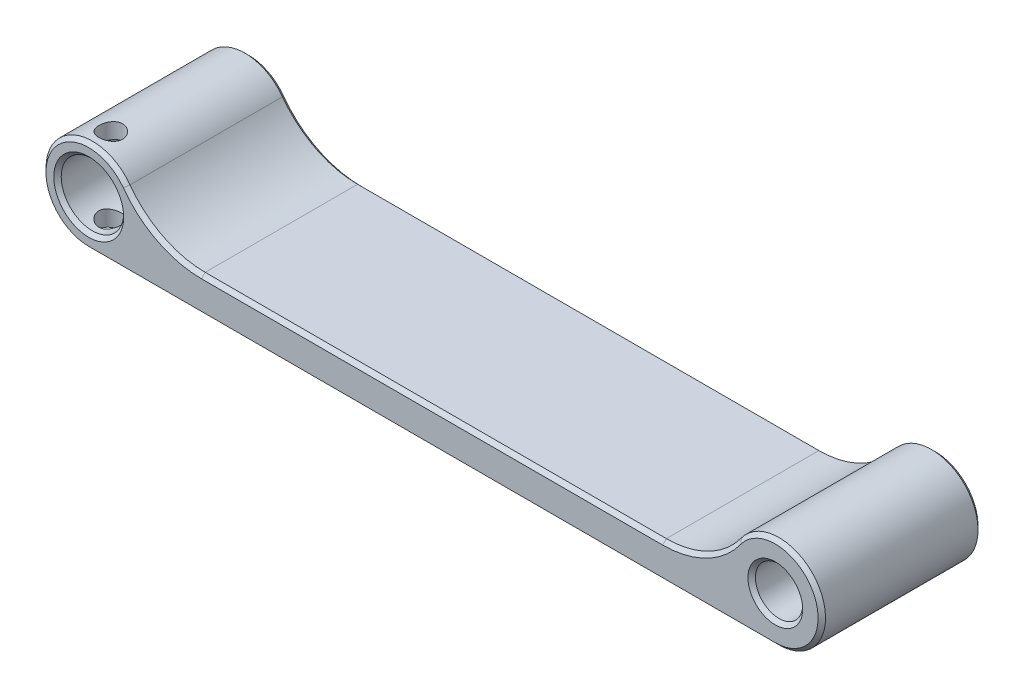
ISO-10303-21;
HEADER;
FILE_DESCRIPTION(('STEP AP214'),'2;1');
FILE_NAME('part.step','',(''),(''),'','','');
FILE_SCHEMA(('AUTOMOTIVE_DESIGN { 1 0 10303 214 1 1 1 1 }'));
ENDSEC;
DATA;
#1=APPLICATION_CONTEXT('core data for automotive mechanical design processes');
#2=APPLICATION_PROTOCOL_DEFINITION('international standard','automotive_design',2000,#1);
#3=PRODUCT_CONTEXT('',#1,'mechanical');
#4=PRODUCT('Part','Part','',(#3));
#5=PRODUCT_RELATED_PRODUCT_CATEGORY('part','',(#4));
#6=PRODUCT_DEFINITION_FORMATION('','',#4);
#7=PRODUCT_DEFINITION_CONTEXT('part definition',#1,'design');
#8=PRODUCT_DEFINITION('design','',#6,#7);
#9=PRODUCT_DEFINITION_SHAPE('','',#8);
#10=(LENGTH_UNIT() NAMED_UNIT(*) SI_UNIT(.MILLI.,.METRE.));
#11=(NAMED_UNIT(*) PLANE_ANGLE_UNIT() SI_UNIT($,.RADIAN.));
#12=(NAMED_UNIT(*) SI_UNIT($,.STERADIAN.) SOLID_ANGLE_UNIT());
#13=UNCERTAINTY_MEASURE_WITH_UNIT(LENGTH_MEASURE(1.E-05),#10,'distance_accuracy_value','');
#14=(GEOMETRIC_REPRESENTATION_CONTEXT(3) GLOBAL_UNCERTAINTY_ASSIGNED_CONTEXT((#13)) GLOBAL_UNIT_ASSIGNED_CONTEXT((#10,
#11,#12)) REPRESENTATION_CONTEXT('',''));
#15=CARTESIAN_POINT('',(0.,0.,0.));
#16=DIRECTION('',(0.,0.,1.));
#17=DIRECTION('',(1.,0.,0.));
#18=AXIS2_PLACEMENT_3D('',#15,#16,#17);
#19=CARTESIAN_POINT('',(10.8701520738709,8.7884,10.922));
#20=DIRECTION('',(0.,0.,-1.));
#21=DIRECTION('',(-1.,0.,0.));
#22=AXIS2_PLACEMENT_3D('',#19,#20,#21);
#23=PLANE('',#22);
#24=CARTESIAN_POINT('',(10.8701520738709,8.7884,10.922));
#25=DIRECTION('',(0.,0.,-1.));
#26=DIRECTION('',(-1.,0.,0.));
#27=AXIS2_PLACEMENT_3D('',#24,#25,#26);
#28=CIRCLE('',#27,6.60400000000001);
#29=CARTESIAN_POINT('',(10.8701520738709,2.18439999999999,10.922));
#30=VERTEX_POINT('',#29);
#31=CARTESIAN_POINT('',(5.53484663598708,4.89644266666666,10.922));
#32=VERTEX_POINT('',#31);
#33=EDGE_CURVE('E216',#30,#32,#28,.T.);
#34=ORIENTED_EDGE('',*,*,#33,.T.);
#35=CARTESIAN_POINT('',(3.175,3.175,10.922));
#36=DIRECTION('',(0.,0.,-1.));
#37=DIRECTION('',(-1.,0.,0.));
#38=AXIS2_PLACEMENT_3D('',#35,#36,#37);
#39=CIRCLE('',#38,2.92099999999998);
#40=CARTESIAN_POINT('',(3.175,0.254000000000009,10.922));
#41=VERTEX_POINT('',#40);
#42=EDGE_CURVE('E218',#32,#41,#39,.F.);
#43=ORIENTED_EDGE('',*,*,#42,.T.);
#44=DIRECTION('',(1.,0.,0.));
#45=VECTOR('',#44,1.);
#46=CARTESIAN_POINT('',(10.8701520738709,0.254000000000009,10.922));
#47=LINE('',#46,#45);
#48=CARTESIAN_POINT('',(50.0634,0.254000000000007,10.922));
#49=VERTEX_POINT('',#48);
#50=EDGE_CURVE('E212',#41,#49,#47,.T.);
#51=ORIENTED_EDGE('',*,*,#50,.T.);
#52=CARTESIAN_POINT('',(50.0634,3.175,10.922));
#53=DIRECTION('',(0.,0.,-1.));
#54=DIRECTION('',(-1.,0.,0.));
#55=AXIS2_PLACEMENT_3D('',#52,#53,#54);
#56=CIRCLE('',#55,2.92099999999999);
#57=CARTESIAN_POINT('',(47.7035533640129,4.89644266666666,10.922));
#58=VERTEX_POINT('',#57);
#59=EDGE_CURVE('E208',#49,#58,#56,.F.);
#60=ORIENTED_EDGE('',*,*,#59,.T.);
#61=CARTESIAN_POINT('',(42.3682479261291,8.7884,10.922));
#62=DIRECTION('',(0.,0.,-1.));
#63=DIRECTION('',(-1.,0.,0.));
#64=AXIS2_PLACEMENT_3D('',#61,#62,#63);
#65=CIRCLE('',#64,6.60400000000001);
#66=CARTESIAN_POINT('',(42.3682479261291,2.18439999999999,10.922));
#67=VERTEX_POINT('',#66);
#68=EDGE_CURVE('E210',#58,#67,#65,.T.);
#69=ORIENTED_EDGE('',*,*,#68,.T.);
#70=DIRECTION('',(-1.,0.,0.));
#71=VECTOR('',#70,1.);
#72=CARTESIAN_POINT('',(10.8701520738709,2.18439999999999,10.922));
#73=LINE('',#72,#71);
#74=EDGE_CURVE('E214',#67,#30,#73,.T.);
#75=ORIENTED_EDGE('',*,*,#74,.T.);
#76=EDGE_LOOP('',(#34,#43,#51,#60,#69,#75));
#77=FACE_BOUND('',#76,.T.);
#78=CARTESIAN_POINT('',(50.0634,3.175,10.922));
#79=DIRECTION('',(0.,0.,-1.));
#80=DIRECTION('',(-1.,0.,0.));
#81=AXIS2_PLACEMENT_3D('',#78,#79,#80);
#82=CIRCLE('',#81,1.8669);
#83=CARTESIAN_POINT('',(48.1965,3.175,10.922));
#84=VERTEX_POINT('',#83);
#85=EDGE_CURVE('E205',#84,#84,#82,.T.);
#86=ORIENTED_EDGE('',*,*,#85,.T.);
#87=EDGE_LOOP('',(#86));
#88=FACE_BOUND('',#87,.T.);
#89=CARTESIAN_POINT('',(3.175,3.175,10.922));
#90=DIRECTION('',(0.,0.,-1.));
#91=DIRECTION('',(-1.,0.,0.));
#92=AXIS2_PLACEMENT_3D('',#89,#90,#91);
#93=CIRCLE('',#92,2.38759999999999);
#94=CARTESIAN_POINT('',(0.78740000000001,3.175,10.922));
#95=VERTEX_POINT('',#94);
#96=EDGE_CURVE('E202',#95,#95,#93,.T.);
#97=ORIENTED_EDGE('',*,*,#96,.T.);
#98=EDGE_LOOP('',(#97));
#99=FACE_BOUND('',#98,.T.);
#100=ADVANCED_FACE('F36',(#77,#88,#99),#23,.F.);
#101=CARTESIAN_POINT('',(10.8701520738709,8.7884,0.));
#102=DIRECTION('',(0.,0.,-1.));
#103=DIRECTION('',(-1.,0.,0.));
#104=AXIS2_PLACEMENT_3D('',#101,#102,#103);
#105=PLANE('',#104);
#106=CARTESIAN_POINT('',(10.8701520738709,8.7884,0.));
#107=DIRECTION('',(0.,0.,-1.));
#108=DIRECTION('',(-1.,0.,0.));
#109=AXIS2_PLACEMENT_3D('',#106,#107,#108);
#110=CIRCLE('',#109,6.604);
#111=CARTESIAN_POINT('',(5.53484663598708,4.89644266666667,0.));
#112=VERTEX_POINT('',#111);
#113=CARTESIAN_POINT('',(10.8701520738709,2.1844,0.));
#114=VERTEX_POINT('',#113);
#115=EDGE_CURVE('E61',#112,#114,#110,.F.);
#116=ORIENTED_EDGE('',*,*,#115,.T.);
#117=DIRECTION('',(1.,0.,0.));
#118=VECTOR('',#117,1.);
#119=CARTESIAN_POINT('',(42.3682479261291,2.1844,0.));
#120=LINE('',#119,#118);
#121=CARTESIAN_POINT('',(42.3682479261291,2.1844,0.));
#122=VERTEX_POINT('',#121);
#123=EDGE_CURVE('E260',#114,#122,#120,.T.);
#124=ORIENTED_EDGE('',*,*,#123,.T.);
#125=CARTESIAN_POINT('',(42.3682479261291,8.7884,0.));
#126=DIRECTION('',(0.,0.,-1.));
#127=DIRECTION('',(-1.,0.,0.));
#128=AXIS2_PLACEMENT_3D('',#125,#126,#127);
#129=CIRCLE('',#128,6.604);
#130=CARTESIAN_POINT('',(47.7035533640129,4.89644266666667,0.));
#131=VERTEX_POINT('',#130);
#132=EDGE_CURVE('E258',#122,#131,#129,.F.);
#133=ORIENTED_EDGE('',*,*,#132,.T.);
#134=CARTESIAN_POINT('',(50.0634,3.175,0.));
#135=DIRECTION('',(0.,0.,-1.));
#136=DIRECTION('',(-1.,0.,0.));
#137=AXIS2_PLACEMENT_3D('',#134,#135,#136);
#138=CIRCLE('',#137,2.921);
#139=CARTESIAN_POINT('',(50.0634,0.253999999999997,0.));
#140=VERTEX_POINT('',#139);
#141=EDGE_CURVE('E255',#131,#140,#138,.T.);
#142=ORIENTED_EDGE('',*,*,#141,.T.);
#143=DIRECTION('',(-1.,0.,0.));
#144=VECTOR('',#143,1.);
#145=CARTESIAN_POINT('',(3.175,0.253999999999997,0.));
#146=LINE('',#145,#144);
#147=CARTESIAN_POINT('',(3.175,0.253999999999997,0.));
#148=VERTEX_POINT('',#147);
#149=EDGE_CURVE('E251',#140,#148,#146,.T.);
#150=ORIENTED_EDGE('',*,*,#149,.T.);
#151=CARTESIAN_POINT('',(3.175,3.175,0.));
#152=DIRECTION('',(0.,0.,-1.));
#153=DIRECTION('',(-1.,0.,0.));
#154=AXIS2_PLACEMENT_3D('',#151,#152,#153);
#155=CIRCLE('',#154,2.921);
#156=EDGE_CURVE('E253',#148,#112,#155,.T.);
#157=ORIENTED_EDGE('',*,*,#156,.T.);
#158=EDGE_LOOP('',(#116,#124,#133,#142,#150,#157));
#159=FACE_BOUND('',#158,.T.);
#160=CARTESIAN_POINT('',(3.175,3.175,0.));
#161=DIRECTION('',(0.,0.,-1.));
#162=DIRECTION('',(-1.,0.,0.));
#163=AXIS2_PLACEMENT_3D('',#160,#161,#162);
#164=CIRCLE('',#163,1.84149999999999);
#165=CARTESIAN_POINT('',(1.33350000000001,3.175,0.));
#166=VERTEX_POINT('',#165);
#167=EDGE_CURVE('E248',#166,#166,#164,.F.);
#168=ORIENTED_EDGE('',*,*,#167,.T.);
#169=EDGE_LOOP('',(#168));
#170=FACE_BOUND('',#169,.T.);
#171=CARTESIAN_POINT('',(50.0634,3.175,0.));
#172=DIRECTION('',(0.,0.,-1.));
#173=DIRECTION('',(-1.,0.,0.));
#174=AXIS2_PLACEMENT_3D('',#171,#172,#173);
#175=CIRCLE('',#174,1.8669);
#176=CARTESIAN_POINT('',(48.1965,3.175,0.));
#177=VERTEX_POINT('',#176);
#178=EDGE_CURVE('E245',#177,#177,#175,.F.);
#179=ORIENTED_EDGE('',*,*,#178,.T.);
#180=EDGE_LOOP('',(#179));
#181=FACE_BOUND('',#180,.T.);
#182=ADVANCED_FACE('F310',(#159,#170,#181),#105,.T.);
#183=CARTESIAN_POINT('',(10.8701520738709,8.7884,10.922));
#184=DIRECTION('',(0.,0.,-1.));
#185=DIRECTION('',(-1.,0.,0.));
#186=AXIS2_PLACEMENT_3D('',#183,#184,#185);
#187=CYLINDRICAL_SURFACE('',#186,6.35);
#188=DIRECTION('',(0.,0.,-1.));
#189=VECTOR('',#188,1.);
#190=CARTESIAN_POINT('',(5.74005069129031,5.04613333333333,10.922));
#191=LINE('',#190,#189);
#192=CARTESIAN_POINT('',(5.74005069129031,5.04613333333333,10.668));
#193=VERTEX_POINT('',#192);
#194=CARTESIAN_POINT('',(5.74005069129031,5.04613333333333,0.25399999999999));
#195=VERTEX_POINT('',#194);
#196=EDGE_CURVE('E148',#193,#195,#191,.T.);
#197=ORIENTED_EDGE('',*,*,#196,.F.);
#198=CARTESIAN_POINT('',(10.8701520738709,8.7884,10.668));
#199=DIRECTION('',(0.,0.,-1.));
#200=DIRECTION('',(-1.,0.,0.));
#201=AXIS2_PLACEMENT_3D('',#198,#199,#200);
#202=CIRCLE('',#201,6.35);
#203=CARTESIAN_POINT('',(10.8701520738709,2.4384,10.668));
#204=VERTEX_POINT('',#203);
#205=EDGE_CURVE('E227',#193,#204,#202,.F.);
#206=ORIENTED_EDGE('',*,*,#205,.T.);
#207=DIRECTION('',(0.,0.,-1.));
#208=VECTOR('',#207,1.);
#209=CARTESIAN_POINT('',(10.8701520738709,2.4384,10.922));
#210=LINE('',#209,#208);
#211=CARTESIAN_POINT('',(10.8701520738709,2.4384,0.25399999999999));
#212=VERTEX_POINT('',#211);
#213=EDGE_CURVE('E330',#204,#212,#210,.T.);
#214=ORIENTED_EDGE('',*,*,#213,.T.);
#215=CARTESIAN_POINT('',(10.8701520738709,8.7884,0.25399999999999));
#216=DIRECTION('',(0.,0.,-1.));
#217=DIRECTION('',(-1.,0.,0.));
#218=AXIS2_PLACEMENT_3D('',#215,#216,#217);
#219=CIRCLE('',#218,6.35);
#220=EDGE_CURVE('E225',#212,#195,#219,.T.);
#221=ORIENTED_EDGE('',*,*,#220,.T.);
#222=EDGE_LOOP('',(#197,#206,#214,#221));
#223=FACE_BOUND('',#222,.T.);
#224=ADVANCED_FACE('F361',(#223),#187,.F.);
#225=CARTESIAN_POINT('',(3.175,3.175,10.922));
#226=DIRECTION('',(0.,0.,-1.));
#227=DIRECTION('',(-1.,0.,0.));
#228=AXIS2_PLACEMENT_3D('',#225,#226,#227);
#229=CYLINDRICAL_SURFACE('',#228,3.175);
#230=CARTESIAN_POINT('',(3.175,6.35,8.6106));
#231=CARTESIAN_POINT('',(3.2198723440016,6.34999926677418,8.61060119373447));
#232=CARTESIAN_POINT('',(3.26475782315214,6.3490392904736,8.61432839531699));
#233=CARTESIAN_POINT('',(3.35324002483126,6.34530284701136,8.62911496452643));
#234=CARTESIAN_POINT('',(3.39683604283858,6.34252540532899,8.64017826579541));
#235=CARTESIAN_POINT('',(3.4814489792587,6.33546123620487,8.66925700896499));
#236=CARTESIAN_POINT('',(3.52246900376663,6.33117636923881,8.68726388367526));
#237=CARTESIAN_POINT('',(3.60090636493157,6.32155244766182,8.72968790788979));
#238=CARTESIAN_POINT('',(3.63832353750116,6.3162133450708,8.75410534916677));
#239=CARTESIAN_POINT('',(3.70929807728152,6.30493102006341,8.8092121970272));
#240=CARTESIAN_POINT('',(3.74276688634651,6.29897811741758,8.84001368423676));
#241=CARTESIAN_POINT('',(3.80412461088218,6.28720266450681,8.90677445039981));
#242=CARTESIAN_POINT('',(3.83201286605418,6.28138012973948,8.9427343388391));
#243=CARTESIAN_POINT('',(3.8818397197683,6.2704265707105,9.01948555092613));
#244=CARTESIAN_POINT('',(3.90367826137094,6.26530780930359,9.06034374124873));
#245=CARTESIAN_POINT('',(3.94014196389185,6.25648294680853,9.14530378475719));
#246=CARTESIAN_POINT('',(3.95476833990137,6.25277660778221,9.18940509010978));
#247=CARTESIAN_POINT('',(3.97608848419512,6.2472958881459,9.27862320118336));
#248=CARTESIAN_POINT('',(3.98294195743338,6.24548267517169,9.32369940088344));
#249=CARTESIAN_POINT('',(3.98901936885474,6.24387734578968,9.41439541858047));
#250=CARTESIAN_POINT('',(3.98824461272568,6.2440848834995,9.46001514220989));
#251=CARTESIAN_POINT('',(3.97921475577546,6.24646275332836,9.54927133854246));
#252=CARTESIAN_POINT('',(3.97115099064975,6.24858287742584,9.5929287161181));
#253=CARTESIAN_POINT('',(3.94807767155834,6.25446688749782,9.67824937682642));
#254=CARTESIAN_POINT('',(3.93306760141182,6.25823089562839,9.71991251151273));
#255=CARTESIAN_POINT('',(3.89636723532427,6.26702396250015,9.80057001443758));
#256=CARTESIAN_POINT('',(3.8746083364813,6.27206591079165,9.8395317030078));
#257=CARTESIAN_POINT('',(3.82507590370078,6.28283960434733,9.91331896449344));
#258=CARTESIAN_POINT('',(3.79730127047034,6.28857147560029,9.94814377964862));
#259=CARTESIAN_POINT('',(3.73553920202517,6.30028973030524,10.0137640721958));
#260=CARTESIAN_POINT('',(3.70139057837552,6.30627859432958,10.0444075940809));
#261=CARTESIAN_POINT('',(3.62836685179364,6.31768150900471,10.0995626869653));
#262=CARTESIAN_POINT('',(3.58949159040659,6.32309554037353,10.1240740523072));
#263=CARTESIAN_POINT('',(3.507894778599,6.3327678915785,10.1663287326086));
#264=CARTESIAN_POINT('',(3.46515937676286,6.33702180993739,10.1840463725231));
#265=CARTESIAN_POINT('',(3.37718327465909,6.34386270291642,10.2120031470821));
#266=CARTESIAN_POINT('',(3.33194307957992,6.34645001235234,10.2222437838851));
#267=CARTESIAN_POINT('',(3.24153994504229,6.34961623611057,10.2347214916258));
#268=CARTESIAN_POINT('',(3.19640732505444,6.35024703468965,10.2371653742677));
#269=CARTESIAN_POINT('',(3.10637768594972,6.3495774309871,10.234548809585));
#270=CARTESIAN_POINT('',(3.06148064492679,6.3482772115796,10.2294890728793));
#271=CARTESIAN_POINT('',(2.97392216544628,6.34392501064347,10.2121790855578));
#272=CARTESIAN_POINT('',(2.93123674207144,6.34090074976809,10.2000425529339));
#273=CARTESIAN_POINT('',(2.84851056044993,6.33344205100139,10.1690541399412));
#274=CARTESIAN_POINT('',(2.80847007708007,6.32900746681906,10.1502015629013));
#275=CARTESIAN_POINT('',(2.73135432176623,6.31909669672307,10.1059215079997));
#276=CARTESIAN_POINT('',(2.69434721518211,6.31360283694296,10.0803793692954));
#277=CARTESIAN_POINT('',(2.62507130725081,6.30220930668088,10.0235909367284));
#278=CARTESIAN_POINT('',(2.59280336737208,6.29630956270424,9.99234360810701));
#279=CARTESIAN_POINT('',(2.5330626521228,6.28458095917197,9.92406971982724));
#280=CARTESIAN_POINT('',(2.50573526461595,6.27875786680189,9.88691473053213));
#281=CARTESIAN_POINT('',(2.4577023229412,6.26801102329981,9.80842521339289));
#282=CARTESIAN_POINT('',(2.43699647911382,6.26308723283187,9.76709086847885));
#283=CARTESIAN_POINT('',(2.40294968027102,6.25475172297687,9.68163341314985));
#284=CARTESIAN_POINT('',(2.38956525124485,6.25133110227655,9.63752853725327));
#285=CARTESIAN_POINT('',(2.37043036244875,6.24638278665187,9.54759292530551));
#286=CARTESIAN_POINT('',(2.36467813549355,6.24485465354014,9.50176259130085));
#287=CARTESIAN_POINT('',(2.36106661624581,6.24389887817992,9.41115959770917));
#288=CARTESIAN_POINT('',(2.36297450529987,6.24440927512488,9.36639672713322));
#289=CARTESIAN_POINT('',(2.37409366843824,6.24732915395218,9.27785381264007));
#290=CARTESIAN_POINT('',(2.38330478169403,6.24973859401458,9.23407374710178));
#291=CARTESIAN_POINT('',(2.4086389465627,6.25614969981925,9.14900641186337));
#292=CARTESIAN_POINT('',(2.42471632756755,6.26014083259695,9.10770469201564));
#293=CARTESIAN_POINT('',(2.46329080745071,6.26926665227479,9.02835469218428));
#294=CARTESIAN_POINT('',(2.48578883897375,6.27440150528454,8.99030688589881));
#295=CARTESIAN_POINT('',(2.53728728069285,6.28541116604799,8.91742452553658));
#296=CARTESIAN_POINT('',(2.56644830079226,6.29130233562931,8.88270591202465));
#297=CARTESIAN_POINT('',(2.63013461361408,6.30306544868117,8.818579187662));
#298=CARTESIAN_POINT('',(2.66466118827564,6.30893738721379,8.78917234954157));
#299=CARTESIAN_POINT('',(2.73890050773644,6.32013539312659,8.73595043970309));
#300=CARTESIAN_POINT('',(2.77870027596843,6.32544877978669,8.71225387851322));
#301=CARTESIAN_POINT('',(2.86185182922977,6.3347955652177,8.67192551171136));
#302=CARTESIAN_POINT('',(2.90520113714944,6.33882984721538,8.65528882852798));
#303=CARTESIAN_POINT('',(2.986203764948,6.3445936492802,8.63191693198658));
#304=CARTESIAN_POINT('',(3.02348370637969,6.34660680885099,8.62394080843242));
#305=CARTESIAN_POINT('',(3.09883932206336,6.34931024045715,8.61328205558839));
#306=CARTESIAN_POINT('',(3.13691492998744,6.35000062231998,8.6105989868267));
#307=CARTESIAN_POINT('',(3.175,6.35,8.6106));
#308=B_SPLINE_CURVE_WITH_KNOTS('',3,(#230,#231,#232,#233,#234,#235,#236,#237,#238,#239,#240,
#241,#242,#243,#244,#245,#246,#247,#248,#249,#250,#251,#252,#253,#254,#255,#256,#257,#258,#259,
#260,#261,#262,#263,#264,#265,#266,#267,#268,#269,#270,#271,#272,#273,#274,#275,#276,#277,#278,
#279,#280,#281,#282,#283,#284,#285,#286,#287,#288,#289,#290,#291,#292,#293,#294,#295,#296,#297,
#298,#299,#300,#301,#302,#303,#304,#305,#306,#307),.UNSPECIFIED.,.T.,.F.,(4,2,2,2,2,2,2,2,2,2,2,
2,2,2,2,2,2,2,2,2,2,2,2,2,2,2,2,2,2,2,2,2,2,2,2,2,2,2,4),(0.,0.134477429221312,
0.269027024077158,0.403411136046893,0.537801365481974,0.674788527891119,0.811791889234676,
0.950941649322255,1.09006795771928,1.22628077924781,1.36247028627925,1.49518545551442,
1.62791048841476,1.76203154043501,1.89617712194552,2.03434121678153,2.1725099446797,
2.31119581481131,2.4498538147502,2.58480189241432,2.71973719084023,2.85256172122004,
2.98540003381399,3.12068404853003,3.25599262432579,3.39479621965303,3.53359374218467,
3.67155789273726,3.80949009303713,3.94326225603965,4.07703147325,4.20992445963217,
4.34283675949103,4.47937410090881,4.61594411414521,4.75514253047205,4.89424461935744,
5.0083908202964,5.12252754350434),.UNSPECIFIED.);
#309=CARTESIAN_POINT('',(3.175,6.35,8.6106));
#310=VERTEX_POINT('',#309);
#311=EDGE_CURVE('E159',#310,#310,#308,.T.);
#312=ORIENTED_EDGE('',*,*,#311,.T.);
#313=EDGE_LOOP('',(#312));
#314=FACE_BOUND('',#313,.T.);
#315=DIRECTION('',(0.,0.,-1.));
#316=VECTOR('',#315,1.);
#317=CARTESIAN_POINT('',(3.175,0.,10.922));
#318=LINE('',#317,#316);
#319=CARTESIAN_POINT('',(3.175,0.,10.668));
#320=VERTEX_POINT('',#319);
#321=CARTESIAN_POINT('',(3.175,0.,10.2362));
#322=VERTEX_POINT('',#321);
#323=EDGE_CURVE('E135',#320,#322,#318,.T.);
#324=ORIENTED_EDGE('',*,*,#323,.F.);
#325=CARTESIAN_POINT('',(3.175,3.175,10.668));
#326=DIRECTION('',(0.,0.,-1.));
#327=DIRECTION('',(-1.,0.,0.));
#328=AXIS2_PLACEMENT_3D('',#325,#326,#327);
#329=CIRCLE('',#328,3.175);
#330=EDGE_CURVE('E223',#320,#193,#329,.T.);
#331=ORIENTED_EDGE('',*,*,#330,.T.);
#332=ORIENTED_EDGE('',*,*,#196,.T.);
#333=CARTESIAN_POINT('',(3.175,3.175,0.25399999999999));
#334=DIRECTION('',(0.,0.,-1.));
#335=DIRECTION('',(-1.,0.,0.));
#336=AXIS2_PLACEMENT_3D('',#333,#334,#335);
#337=CIRCLE('',#336,3.175);
#338=CARTESIAN_POINT('',(3.175,0.,0.25399999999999));
#339=VERTEX_POINT('',#338);
#340=EDGE_CURVE('E221',#195,#339,#337,.F.);
#341=ORIENTED_EDGE('',*,*,#340,.T.);
#342=CARTESIAN_POINT('',(3.175,0.,8.6106));
#343=VERTEX_POINT('',#342);
#344=EDGE_CURVE('E149',#343,#339,#318,.T.);
#345=ORIENTED_EDGE('',*,*,#344,.F.);
#346=CARTESIAN_POINT('',(3.175,0.,8.6106));
#347=CARTESIAN_POINT('',(3.1300471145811,-3.53100597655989E-05,8.61055776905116));
#348=CARTESIAN_POINT('',(3.08512127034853,0.000953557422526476,8.61432637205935));
#349=CARTESIAN_POINT('',(2.9966548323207,0.00471383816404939,8.62915476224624));
#350=CARTESIAN_POINT('',(2.95311163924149,0.00748166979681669,8.64019990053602));
#351=CARTESIAN_POINT('',(2.86855380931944,0.0145358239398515,8.66925239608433));
#352=CARTESIAN_POINT('',(2.82753902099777,0.0188220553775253,8.68725933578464));
#353=CARTESIAN_POINT('',(2.74910175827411,0.0284471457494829,8.7296837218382));
#354=CARTESIAN_POINT('',(2.71168018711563,0.033786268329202,8.7541027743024));
#355=CARTESIAN_POINT('',(2.64070309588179,0.0450685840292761,8.80921096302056));
#356=CARTESIAN_POINT('',(2.60723550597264,0.0510214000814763,8.84001138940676));
#357=CARTESIAN_POINT('',(2.54587744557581,0.0627969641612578,8.9067719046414));
#358=CARTESIAN_POINT('',(2.51798803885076,0.068619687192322,8.94273297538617));
#359=CARTESIAN_POINT('',(2.46815962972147,0.0795735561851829,9.0194865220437));
#360=CARTESIAN_POINT('',(2.44632062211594,0.0846924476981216,9.06034582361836));
#361=CARTESIAN_POINT('',(2.40985729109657,0.0935172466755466,9.14530603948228));
#362=CARTESIAN_POINT('',(2.39523138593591,0.0972234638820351,9.18940624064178));
#363=CARTESIAN_POINT('',(2.37391163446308,0.102704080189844,9.27862270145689));
#364=CARTESIAN_POINT('',(2.36705819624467,0.10451728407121,9.32369838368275));
#365=CARTESIAN_POINT('',(2.36098061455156,0.106122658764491,9.41439439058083));
#366=CARTESIAN_POINT('',(2.36175533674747,0.105915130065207,9.46001463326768));
#367=CARTESIAN_POINT('',(2.37078526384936,0.103537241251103,9.54927154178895));
#368=CARTESIAN_POINT('',(2.37884908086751,0.101417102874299,9.59292911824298));
#369=CARTESIAN_POINT('',(2.40192246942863,0.0955330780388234,9.67824976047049));
#370=CARTESIAN_POINT('',(2.41693249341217,0.091769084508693,9.71991269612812));
#371=CARTESIAN_POINT('',(2.45363295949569,0.0829759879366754,9.80057046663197));
#372=CARTESIAN_POINT('',(2.47539210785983,0.0779339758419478,9.83953257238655));
#373=CARTESIAN_POINT('',(2.52492476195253,0.0671602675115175,9.91331974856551));
#374=CARTESIAN_POINT('',(2.55269923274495,0.0614284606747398,9.94814415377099));
#375=CARTESIAN_POINT('',(2.61445714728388,0.0497109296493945,10.01376035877));
#376=CARTESIAN_POINT('',(2.64860119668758,0.0437227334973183,10.0444007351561));
#377=CARTESIAN_POINT('',(2.72162508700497,0.0323197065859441,10.0995572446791));
#378=CARTESIAN_POINT('',(2.76050613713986,0.0269050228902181,10.1240718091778));
#379=CARTESIAN_POINT('',(2.84212889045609,0.0172290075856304,10.1663420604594));
#380=CARTESIAN_POINT('',(2.88488636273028,0.012972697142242,10.1840684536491));
#381=CARTESIAN_POINT('',(2.97288302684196,0.00613407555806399,10.2120166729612));
#382=CARTESIAN_POINT('',(3.0181184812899,0.00354931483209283,10.2222494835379));
#383=CARTESIAN_POINT('',(3.08229019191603,0.00129972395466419,10.2311105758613));
#384=CARTESIAN_POINT('',(3.10079285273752,0.000812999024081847,10.2330194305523));
#385=CARTESIAN_POINT('',(3.13786073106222,0.000163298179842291,10.2355627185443));
#386=CARTESIAN_POINT('',(3.15642579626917,-2.07212490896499E-07,10.2361992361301));
#387=CARTESIAN_POINT('',(3.175,0.,10.2362));
#388=B_SPLINE_CURVE_WITH_KNOTS('',3,(#346,#347,#348,#349,#350,#351,#352,#353,#354,#355,#356,
#357,#358,#359,#360,#361,#362,#363,#364,#365,#366,#367,#368,#369,#370,#371,#372,#373,#374,#375,
#376,#377,#378,#379,#380,#381,#382,#383,#384,#385,#386,#387),.UNSPECIFIED.,.F.,.F.,(4,2,2,2,2,2,
2,2,2,2,2,2,2,2,2,2,2,2,2,2,4),(0.,0.134648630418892,0.269027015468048,0.403397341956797,
0.537801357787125,0.674783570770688,0.811791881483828,0.950945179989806,1.09006795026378,
1.22627924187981,1.36247027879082,1.49518605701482,1.6279104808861,1.76203303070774,
1.89617711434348,2.03432585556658,2.17250993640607,2.31128378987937,2.44985381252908,
2.50563810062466,2.56133093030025),.UNSPECIFIED.);
#389=EDGE_CURVE('E153',#343,#322,#388,.T.);
#390=ORIENTED_EDGE('',*,*,#389,.T.);
#391=EDGE_LOOP('',(#324,#331,#332,#341,#345,#390));
#392=FACE_BOUND('',#391,.T.);
#393=ADVANCED_FACE('F157',(#314,#392),#229,.T.);
#394=CARTESIAN_POINT('',(3.175,0.,10.922));
#395=DIRECTION('',(0.,1.,0.));
#396=DIRECTION('',(0.,0.,1.));
#397=AXIS2_PLACEMENT_3D('',#394,#395,#396);
#398=PLANE('',#397);
#399=DIRECTION('',(0.,0.,-1.));
#400=VECTOR('',#399,1.);
#401=CARTESIAN_POINT('',(50.0634,0.,10.922));
#402=LINE('',#401,#400);
#403=CARTESIAN_POINT('',(50.0634,0.,10.668));
#404=VERTEX_POINT('',#403);
#405=CARTESIAN_POINT('',(50.0634,0.,0.25399999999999));
#406=VERTEX_POINT('',#405);
#407=EDGE_CURVE('E332',#404,#406,#402,.T.);
#408=ORIENTED_EDGE('',*,*,#407,.F.);
#409=DIRECTION('',(-1.,0.,0.));
#410=VECTOR('',#409,1.);
#411=CARTESIAN_POINT('',(3.175,0.,10.668));
#412=LINE('',#411,#410);
#413=EDGE_CURVE('E143',#404,#320,#412,.T.);
#414=ORIENTED_EDGE('',*,*,#413,.T.);
#415=ORIENTED_EDGE('',*,*,#323,.T.);
#416=CARTESIAN_POINT('',(3.175,0.,9.4234));
#417=DIRECTION('',(0.,-1.,0.));
#418=DIRECTION('',(0.,0.,-1.));
#419=AXIS2_PLACEMENT_3D('',#416,#417,#418);
#420=CIRCLE('',#419,0.8128);
#421=EDGE_CURVE('E140',#343,#322,#420,.T.);
#422=ORIENTED_EDGE('',*,*,#421,.F.);
#423=ORIENTED_EDGE('',*,*,#344,.T.);
#424=DIRECTION('',(1.,0.,0.));
#425=VECTOR('',#424,1.);
#426=CARTESIAN_POINT('',(50.0634,0.,0.25399999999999));
#427=LINE('',#426,#425);
#428=EDGE_CURVE('E234',#339,#406,#427,.T.);
#429=ORIENTED_EDGE('',*,*,#428,.T.);
#430=EDGE_LOOP('',(#408,#414,#415,#422,#423,#429));
#431=FACE_BOUND('',#430,.T.);
#432=ADVANCED_FACE('F138',(#431),#398,.F.);
#433=CARTESIAN_POINT('',(50.0634,3.175,10.922));
#434=DIRECTION('',(0.,0.,-1.));
#435=DIRECTION('',(-1.,0.,0.));
#436=AXIS2_PLACEMENT_3D('',#433,#434,#435);
#437=CYLINDRICAL_SURFACE('',#436,3.175);
#438=DIRECTION('',(0.,0.,-1.));
#439=VECTOR('',#438,1.);
#440=CARTESIAN_POINT('',(47.4983493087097,5.04613333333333,10.922));
#441=LINE('',#440,#439);
#442=CARTESIAN_POINT('',(47.4983493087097,5.04613333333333,10.668));
#443=VERTEX_POINT('',#442);
#444=CARTESIAN_POINT('',(47.4983493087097,5.04613333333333,0.25399999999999));
#445=VERTEX_POINT('',#444);
#446=EDGE_CURVE('E324',#443,#445,#441,.T.);
#447=ORIENTED_EDGE('',*,*,#446,.F.);
#448=CARTESIAN_POINT('',(50.0634,3.175,10.668));
#449=DIRECTION('',(0.,0.,-1.));
#450=DIRECTION('',(-1.,0.,0.));
#451=AXIS2_PLACEMENT_3D('',#448,#449,#450);
#452=CIRCLE('',#451,3.175);
#453=EDGE_CURVE('E243',#443,#404,#452,.T.);
#454=ORIENTED_EDGE('',*,*,#453,.T.);
#455=ORIENTED_EDGE('',*,*,#407,.T.);
#456=CARTESIAN_POINT('',(50.0634,3.175,0.25399999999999));
#457=DIRECTION('',(0.,0.,-1.));
#458=DIRECTION('',(-1.,0.,0.));
#459=AXIS2_PLACEMENT_3D('',#456,#457,#458);
#460=CIRCLE('',#459,3.175);
#461=EDGE_CURVE('E241',#406,#445,#460,.F.);
#462=ORIENTED_EDGE('',*,*,#461,.T.);
#463=EDGE_LOOP('',(#447,#454,#455,#462));
#464=FACE_BOUND('',#463,.T.);
#465=ADVANCED_FACE('F369',(#464),#437,.T.);
#466=CARTESIAN_POINT('',(42.3682479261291,8.7884,10.922));
#467=DIRECTION('',(0.,0.,-1.));
#468=DIRECTION('',(-1.,0.,0.));
#469=AXIS2_PLACEMENT_3D('',#466,#467,#468);
#470=CYLINDRICAL_SURFACE('',#469,6.35);
#471=DIRECTION('',(0.,0.,-1.));
#472=VECTOR('',#471,1.);
#473=CARTESIAN_POINT('',(42.3682479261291,2.4384,10.922));
#474=LINE('',#473,#472);
#475=CARTESIAN_POINT('',(42.3682479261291,2.4384,10.668));
#476=VERTEX_POINT('',#475);
#477=CARTESIAN_POINT('',(42.3682479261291,2.4384,0.25399999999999));
#478=VERTEX_POINT('',#477);
#479=EDGE_CURVE('E321',#476,#478,#474,.T.);
#480=ORIENTED_EDGE('',*,*,#479,.F.);
#481=CARTESIAN_POINT('',(42.3682479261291,8.7884,10.668));
#482=DIRECTION('',(0.,0.,-1.));
#483=DIRECTION('',(-1.,0.,0.));
#484=AXIS2_PLACEMENT_3D('',#481,#482,#483);
#485=CIRCLE('',#484,6.35);
#486=EDGE_CURVE('E239',#476,#443,#485,.F.);
#487=ORIENTED_EDGE('',*,*,#486,.T.);
#488=ORIENTED_EDGE('',*,*,#446,.T.);
#489=CARTESIAN_POINT('',(42.3682479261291,8.7884,0.25399999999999));
#490=DIRECTION('',(0.,0.,-1.));
#491=DIRECTION('',(-1.,0.,0.));
#492=AXIS2_PLACEMENT_3D('',#489,#490,#491);
#493=CIRCLE('',#492,6.35);
#494=EDGE_CURVE('E237',#445,#478,#493,.T.);
#495=ORIENTED_EDGE('',*,*,#494,.T.);
#496=EDGE_LOOP('',(#480,#487,#488,#495));
#497=FACE_BOUND('',#496,.T.);
#498=ADVANCED_FACE('F320',(#497),#470,.F.);
#499=CARTESIAN_POINT('',(10.8701520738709,2.4384,10.922));
#500=DIRECTION('',(0.,-1.,0.));
#501=DIRECTION('',(0.,0.,-1.));
#502=AXIS2_PLACEMENT_3D('',#499,#500,#501);
#503=PLANE('',#502);
#504=ORIENTED_EDGE('',*,*,#213,.F.);
#505=DIRECTION('',(1.,0.,0.));
#506=VECTOR('',#505,1.);
#507=CARTESIAN_POINT('',(10.8701520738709,2.4384,10.668));
#508=LINE('',#507,#506);
#509=EDGE_CURVE('E232',#204,#476,#508,.T.);
#510=ORIENTED_EDGE('',*,*,#509,.T.);
#511=ORIENTED_EDGE('',*,*,#479,.T.);
#512=DIRECTION('',(-1.,0.,0.));
#513=VECTOR('',#512,1.);
#514=CARTESIAN_POINT('',(10.8701520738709,2.4384,0.25399999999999));
#515=LINE('',#514,#513);
#516=EDGE_CURVE('E229',#478,#212,#515,.T.);
#517=ORIENTED_EDGE('',*,*,#516,.T.);
#518=EDGE_LOOP('',(#504,#510,#511,#517));
#519=FACE_BOUND('',#518,.T.);
#520=ADVANCED_FACE('F327',(#519),#503,.F.);
#521=CARTESIAN_POINT('',(50.0634,3.175,10.922));
#522=DIRECTION('',(0.,0.,-1.));
#523=DIRECTION('',(-1.,0.,0.));
#524=AXIS2_PLACEMENT_3D('',#521,#522,#523);
#525=CYLINDRICAL_SURFACE('',#524,1.6129);
#526=CARTESIAN_POINT('',(50.0634,3.175,0.253999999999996));
#527=DIRECTION('',(0.,0.,-1.));
#528=DIRECTION('',(-1.,0.,0.));
#529=AXIS2_PLACEMENT_3D('',#526,#527,#528);
#530=CIRCLE('',#529,1.6129);
#531=CARTESIAN_POINT('',(48.4505,3.175,0.253999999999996));
#532=VERTEX_POINT('',#531);
#533=EDGE_CURVE('E45',#532,#532,#530,.T.);
#534=ORIENTED_EDGE('',*,*,#533,.T.);
#535=EDGE_LOOP('',(#534));
#536=FACE_BOUND('',#535,.T.);
#537=CARTESIAN_POINT('',(50.0634,3.175,10.668));
#538=DIRECTION('',(0.,0.,-1.));
#539=DIRECTION('',(-1.,0.,0.));
#540=AXIS2_PLACEMENT_3D('',#537,#538,#539);
#541=CIRCLE('',#540,1.6129);
#542=CARTESIAN_POINT('',(48.4505,3.175,10.668));
#543=VERTEX_POINT('',#542);
#544=EDGE_CURVE('E265',#543,#543,#541,.F.);
#545=ORIENTED_EDGE('',*,*,#544,.T.);
#546=EDGE_LOOP('',(#545));
#547=FACE_BOUND('',#546,.T.);
#548=ADVANCED_FACE('F346',(#536,#547),#525,.F.);
#549=CARTESIAN_POINT('',(3.175,3.175,10.922));
#550=DIRECTION('',(0.,0.,-1.));
#551=DIRECTION('',(-1.,0.,0.));
#552=AXIS2_PLACEMENT_3D('',#549,#550,#551);
#553=CYLINDRICAL_SURFACE('',#552,1.5875);
#554=CARTESIAN_POINT('',(3.175,3.175,0.253999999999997));
#555=DIRECTION('',(0.,0.,-1.));
#556=DIRECTION('',(-1.,0.,0.));
#557=AXIS2_PLACEMENT_3D('',#554,#555,#556);
#558=CIRCLE('',#557,1.5875);
#559=CARTESIAN_POINT('',(1.5875,3.175,0.253999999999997));
#560=VERTEX_POINT('',#559);
#561=EDGE_CURVE('E262',#560,#560,#558,.T.);
#562=ORIENTED_EDGE('',*,*,#561,.T.);
#563=EDGE_LOOP('',(#562));
#564=FACE_BOUND('',#563,.T.);
#565=CARTESIAN_POINT('',(3.175,3.175,2.1082));
#566=DIRECTION('',(0.,0.,-1.));
#567=DIRECTION('',(-1.,0.,0.));
#568=AXIS2_PLACEMENT_3D('',#565,#566,#567);
#569=CIRCLE('',#568,1.5875);
#570=CARTESIAN_POINT('',(1.5875,3.175,2.1082));
#571=VERTEX_POINT('',#570);
#572=EDGE_CURVE('E162',#571,#571,#569,.T.);
#573=ORIENTED_EDGE('',*,*,#572,.F.);
#574=EDGE_LOOP('',(#573));
#575=FACE_BOUND('',#574,.T.);
#576=ADVANCED_FACE('F344',(#564,#575),#553,.F.);
#577=CARTESIAN_POINT('',(10.8701520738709,8.7884,2.1082));
#578=DIRECTION('',(0.,0.,-1.));
#579=DIRECTION('',(-1.,0.,0.));
#580=AXIS2_PLACEMENT_3D('',#577,#578,#579);
#581=PLANE('',#580);
#582=ORIENTED_EDGE('',*,*,#572,.T.);
#583=EDGE_LOOP('',(#582));
#584=FACE_BOUND('',#583,.T.);
#585=CARTESIAN_POINT('',(3.175,3.175,2.1082));
#586=DIRECTION('',(0.,0.,-1.));
#587=DIRECTION('',(-1.,0.,0.));
#588=AXIS2_PLACEMENT_3D('',#585,#586,#587);
#589=CIRCLE('',#588,2.1336);
#590=CARTESIAN_POINT('',(1.0414,3.175,2.1082));
#591=VERTEX_POINT('',#590);
#592=EDGE_CURVE('E158',#591,#591,#589,.F.);
#593=ORIENTED_EDGE('',*,*,#592,.T.);
#594=EDGE_LOOP('',(#593));
#595=FACE_BOUND('',#594,.T.);
#596=ADVANCED_FACE('F341',(#584,#595),#581,.F.);
#597=CARTESIAN_POINT('',(3.175,3.175,-6.03473211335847));
#598=DIRECTION('',(0.,0.,1.));
#599=DIRECTION('',(1.,0.,0.));
#600=AXIS2_PLACEMENT_3D('',#597,#598,#599);
#601=CYLINDRICAL_SURFACE('',#600,2.1336);
#602=CARTESIAN_POINT('',(3.175,3.175,10.668));
#603=DIRECTION('',(0.,0.,-1.));
#604=DIRECTION('',(-1.,0.,0.));
#605=AXIS2_PLACEMENT_3D('',#602,#603,#604);
#606=CIRCLE('',#605,2.1336);
#607=CARTESIAN_POINT('',(1.0414,3.175,10.668));
#608=VERTEX_POINT('',#607);
#609=EDGE_CURVE('E12',#608,#608,#606,.F.);
#610=ORIENTED_EDGE('',*,*,#609,.T.);
#611=EDGE_LOOP('',(#610));
#612=FACE_BOUND('',#611,.T.);
#613=CARTESIAN_POINT('',(3.175,5.3086,8.6106));
#614=CARTESIAN_POINT('',(3.1310312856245,5.30860137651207,8.61059818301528));
#615=CARTESIAN_POINT('',(3.08707480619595,5.30722914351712,8.61417882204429));
#616=CARTESIAN_POINT('',(3.0004782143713,5.30189252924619,8.62834659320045));
#617=CARTESIAN_POINT('',(2.95783786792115,5.29792861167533,8.63893247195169));
#618=CARTESIAN_POINT('',(2.87513514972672,5.28783329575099,8.66668017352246));
#619=CARTESIAN_POINT('',(2.83506788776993,5.2817061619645,8.68382906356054));
#620=CARTESIAN_POINT('',(2.7583826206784,5.26789247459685,8.7241491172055));
#621=CARTESIAN_POINT('',(2.72176557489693,5.26020548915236,8.74732194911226));
#622=CARTESIAN_POINT('',(2.65142277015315,5.24368868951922,8.80008694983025));
#623=CARTESIAN_POINT('',(2.61786730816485,5.23482582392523,8.82989569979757));
#624=CARTESIAN_POINT('',(2.55609351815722,5.21711611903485,8.89462660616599));
#625=CARTESIAN_POINT('',(2.52787690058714,5.20826928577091,8.92955039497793));
#626=CARTESIAN_POINT('',(2.47648142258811,5.19120543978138,9.00520415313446));
#627=CARTESIAN_POINT('',(2.45354609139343,5.18302720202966,9.04610919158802));
#628=CARTESIAN_POINT('',(2.41495656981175,5.16874259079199,9.13155629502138));
#629=CARTESIAN_POINT('',(2.39929936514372,5.16263535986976,9.17609684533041));
#630=CARTESIAN_POINT('',(2.37638777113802,5.15353848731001,9.26558793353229));
#631=CARTESIAN_POINT('',(2.36880763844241,5.15042851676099,9.31044242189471));
#632=CARTESIAN_POINT('',(2.36124702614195,5.14732691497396,9.40088628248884));
#633=CARTESIAN_POINT('',(2.36126327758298,5.14733394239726,9.44647533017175));
#634=CARTESIAN_POINT('',(2.36864642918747,5.15036205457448,9.53408000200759));
#635=CARTESIAN_POINT('',(2.37555695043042,5.15319600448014,9.57614177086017));
#636=CARTESIAN_POINT('',(2.39577649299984,5.1612469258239,9.65845619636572));
#637=CARTESIAN_POINT('',(2.40908650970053,5.16646426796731,9.698708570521));
#638=CARTESIAN_POINT('',(2.44197092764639,5.17880381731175,9.77717587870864));
#639=CARTESIAN_POINT('',(2.46166122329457,5.18596083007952,9.81533652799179));
#640=CARTESIAN_POINT('',(2.5066663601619,5.20136219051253,9.8879427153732));
#641=CARTESIAN_POINT('',(2.53198318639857,5.20960692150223,9.92238693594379));
#642=CARTESIAN_POINT('',(2.58959471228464,5.22695383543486,9.9891023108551));
#643=CARTESIAN_POINT('',(2.62225220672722,5.23607577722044,10.0210558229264));
#644=CARTESIAN_POINT('',(2.69256550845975,5.25365772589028,10.0791287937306));
#645=CARTESIAN_POINT('',(2.73022213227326,5.26211762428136,10.1052472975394));
#646=CARTESIAN_POINT('',(2.81029602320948,5.2776001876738,10.151274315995));
#647=CARTESIAN_POINT('',(2.85278128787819,5.28459698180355,10.1710738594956));
#648=CARTESIAN_POINT('',(2.94081286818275,5.29617226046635,10.203138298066));
#649=CARTESIAN_POINT('',(2.98635776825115,5.30075185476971,10.2154066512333));
#650=CARTESIAN_POINT('',(3.07654492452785,5.30677997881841,10.2314424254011));
#651=CARTESIAN_POINT('',(3.12110071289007,5.30838579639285,10.235637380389));
#652=CARTESIAN_POINT('',(3.21030355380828,5.30877368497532,10.2366562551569));
#653=CARTESIAN_POINT('',(3.25495058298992,5.30755640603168,10.2334818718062));
#654=CARTESIAN_POINT('',(3.34120006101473,5.30253849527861,10.2201747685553));
#655=CARTESIAN_POINT('',(3.38285290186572,5.29884291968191,10.2103248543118));
#656=CARTESIAN_POINT('',(3.46388332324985,5.28934642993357,10.184321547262));
#657=CARTESIAN_POINT('',(3.50326060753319,5.28354524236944,10.1681673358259));
#658=CARTESIAN_POINT('',(3.57993475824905,5.27019377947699,10.1294950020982));
#659=CARTESIAN_POINT('',(3.61713501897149,5.26259664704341,10.1068020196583));
#660=CARTESIAN_POINT('',(3.68732582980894,5.24648983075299,10.0558930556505));
#661=CARTESIAN_POINT('',(3.7203147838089,5.23797980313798,10.0276749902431));
#662=CARTESIAN_POINT('',(3.78321491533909,5.22034939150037,9.96452941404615));
#663=CARTESIAN_POINT('',(3.8128233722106,5.21122298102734,9.92930125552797));
#664=CARTESIAN_POINT('',(3.86577162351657,5.19387642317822,9.85420077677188));
#665=CARTESIAN_POINT('',(3.88911075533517,5.18565637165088,9.81432796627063));
#666=CARTESIAN_POINT('',(3.92890783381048,5.17107762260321,9.73068176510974));
#667=CARTESIAN_POINT('',(3.9453284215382,5.16472908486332,9.68688870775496));
#668=CARTESIAN_POINT('',(3.9704497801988,5.15482182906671,9.59684834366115));
#669=CARTESIAN_POINT('',(3.97915553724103,5.15126130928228,9.55060264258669));
#670=CARTESIAN_POINT('',(3.98814707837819,5.14757754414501,9.46026167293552));
#671=CARTESIAN_POINT('',(3.98895120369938,5.14724272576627,9.41622621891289));
#672=CARTESIAN_POINT('',(3.98345240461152,5.14950306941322,9.32868221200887));
#673=CARTESIAN_POINT('',(3.97715020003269,5.1520979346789,9.28517360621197));
#674=CARTESIAN_POINT('',(3.95802603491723,5.15974663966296,9.20135763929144));
#675=CARTESIAN_POINT('',(3.94542271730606,5.16471778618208,9.16099218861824));
#676=CARTESIAN_POINT('',(3.91424939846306,5.1765083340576,9.08292684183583));
#677=CARTESIAN_POINT('',(3.89567786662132,5.18332820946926,9.04522763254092));
#678=CARTESIAN_POINT('',(3.85194098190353,5.19850247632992,8.97136640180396));
#679=CARTESIAN_POINT('',(3.82647550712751,5.20691953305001,8.93539514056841));
#680=CARTESIAN_POINT('',(3.77013202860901,5.22413002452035,8.86807125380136));
#681=CARTESIAN_POINT('',(3.73925227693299,5.23292358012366,8.83672012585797));
#682=CARTESIAN_POINT('',(3.67087053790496,5.2504937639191,8.77771588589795));
#683=CARTESIAN_POINT('',(3.63309277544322,5.25924130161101,8.75037224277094));
#684=CARTESIAN_POINT('',(3.55316995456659,5.27521332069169,8.70242632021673));
#685=CARTESIAN_POINT('',(3.51102431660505,5.28243759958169,8.68182493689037));
#686=CARTESIAN_POINT('',(3.42100703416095,5.2948831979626,8.64714051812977));
#687=CARTESIAN_POINT('',(3.37294609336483,5.29996734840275,8.63349448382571));
#688=CARTESIAN_POINT('',(3.27491746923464,5.30682406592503,8.61522771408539));
#689=CARTESIAN_POINT('',(3.22495083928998,5.30859843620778,8.61060206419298));
#690=CARTESIAN_POINT('',(3.175,5.3086,8.6106));
#691=B_SPLINE_CURVE_WITH_KNOTS('',3,(#613,#614,#615,#616,#617,#618,#619,#620,#621,#622,#623,
#624,#625,#626,#627,#628,#629,#630,#631,#632,#633,#634,#635,#636,#637,#638,#639,#640,#641,#642,
#643,#644,#645,#646,#647,#648,#649,#650,#651,#652,#653,#654,#655,#656,#657,#658,#659,#660,#661,
#662,#663,#664,#665,#666,#667,#668,#669,#670,#671,#672,#673,#674,#675,#676,#677,#678,#679,#680,
#681,#682,#683,#684,#685,#686,#687,#688,#689,#690),.UNSPECIFIED.,.T.,.F.,(4,2,2,2,2,2,2,2,2,2,2,
2,2,2,2,2,2,2,2,2,2,2,2,2,2,2,2,2,2,2,2,2,2,2,2,2,2,2,4),(0.,0.131721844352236,
0.263420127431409,0.394860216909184,0.526336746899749,0.662982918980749,0.799672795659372,
0.941771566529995,1.0838114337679,1.21987671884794,1.35588345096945,1.48344710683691,
1.61103061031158,1.74107535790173,1.87116605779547,2.01030254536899,2.1494617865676,
2.29090525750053,2.43228373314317,2.56594379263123,2.69957307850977,2.82786843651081,
2.95618045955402,3.08830575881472,3.22048098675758,3.36057345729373,3.50068072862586,
3.64153514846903,3.7822984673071,3.91376084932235,4.04520991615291,4.17238510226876,
4.29959292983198,4.43362043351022,4.56769128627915,4.70934547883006,4.85101849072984,
5.00074323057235,5.15038637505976),.UNSPECIFIED.);
#692=CARTESIAN_POINT('',(3.175,5.3086,8.6106));
#693=VERTEX_POINT('',#692);
#694=EDGE_CURVE('E165',#693,#693,#691,.T.);
#695=ORIENTED_EDGE('',*,*,#694,.T.);
#696=EDGE_LOOP('',(#695));
#697=FACE_BOUND('',#696,.T.);
#698=CARTESIAN_POINT('',(3.175,1.0414,8.6106));
#699=CARTESIAN_POINT('',(3.2189687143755,1.04139862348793,8.61059818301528));
#700=CARTESIAN_POINT('',(3.26292519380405,1.04277085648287,8.61417882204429));
#701=CARTESIAN_POINT('',(3.3495217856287,1.04810747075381,8.62834659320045));
#702=CARTESIAN_POINT('',(3.39216213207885,1.05207138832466,8.63893247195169));
#703=CARTESIAN_POINT('',(3.47486485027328,1.062166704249,8.66668017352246));
#704=CARTESIAN_POINT('',(3.51493211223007,1.06829383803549,8.68382906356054));
#705=CARTESIAN_POINT('',(3.5916173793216,1.08210752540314,8.7241491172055));
#706=CARTESIAN_POINT('',(3.62823442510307,1.08979451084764,8.74732194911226));
#707=CARTESIAN_POINT('',(3.69857722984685,1.10631131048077,8.80008694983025));
#708=CARTESIAN_POINT('',(3.73213269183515,1.11517417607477,8.82989569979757));
#709=CARTESIAN_POINT('',(3.79390648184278,1.13288388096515,8.89462660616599));
#710=CARTESIAN_POINT('',(3.82212309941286,1.14173071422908,8.92955039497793));
#711=CARTESIAN_POINT('',(3.87351857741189,1.15879456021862,9.00520415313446));
#712=CARTESIAN_POINT('',(3.89645390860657,1.16697279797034,9.04610919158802));
#713=CARTESIAN_POINT('',(3.93504343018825,1.181257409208,9.13155629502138));
#714=CARTESIAN_POINT('',(3.95070063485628,1.18736464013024,9.17609684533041));
#715=CARTESIAN_POINT('',(3.97361222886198,1.19646151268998,9.26558793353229));
#716=CARTESIAN_POINT('',(3.98119236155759,1.199571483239,9.31044242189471));
#717=CARTESIAN_POINT('',(3.98875297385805,1.20267308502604,9.40088628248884));
#718=CARTESIAN_POINT('',(3.98873672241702,1.20266605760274,9.44647533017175));
#719=CARTESIAN_POINT('',(3.98135357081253,1.19963794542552,9.53408000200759));
#720=CARTESIAN_POINT('',(3.97444304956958,1.19680399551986,9.57614177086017));
#721=CARTESIAN_POINT('',(3.95422350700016,1.18875307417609,9.65845619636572));
#722=CARTESIAN_POINT('',(3.94091349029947,1.18353573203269,9.698708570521));
#723=CARTESIAN_POINT('',(3.90802907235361,1.17119618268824,9.77717587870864));
#724=CARTESIAN_POINT('',(3.88833877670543,1.16403916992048,9.81533652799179));
#725=CARTESIAN_POINT('',(3.8433336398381,1.14863780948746,9.8879427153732));
#726=CARTESIAN_POINT('',(3.81801681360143,1.14039307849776,9.92238693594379));
#727=CARTESIAN_POINT('',(3.76040528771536,1.12304616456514,9.9891023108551));
#728=CARTESIAN_POINT('',(3.72774779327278,1.11392422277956,10.0210558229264));
#729=CARTESIAN_POINT('',(3.65743449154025,1.09634227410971,10.0791287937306));
#730=CARTESIAN_POINT('',(3.61977786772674,1.08788237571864,10.1052472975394));
#731=CARTESIAN_POINT('',(3.53970397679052,1.0723998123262,10.151274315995));
#732=CARTESIAN_POINT('',(3.49721871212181,1.06540301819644,10.1710738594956));
#733=CARTESIAN_POINT('',(3.40918713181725,1.05382773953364,10.203138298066));
#734=CARTESIAN_POINT('',(3.36364223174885,1.04924814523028,10.2154066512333));
#735=CARTESIAN_POINT('',(3.27345507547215,1.04322002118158,10.2314424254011));
#736=CARTESIAN_POINT('',(3.22889928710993,1.04161420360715,10.235637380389));
#737=CARTESIAN_POINT('',(3.13969644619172,1.04122631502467,10.2366562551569));
#738=CARTESIAN_POINT('',(3.09504941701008,1.04244359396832,10.2334818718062));
#739=CARTESIAN_POINT('',(3.00879993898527,1.04746150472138,10.2201747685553));
#740=CARTESIAN_POINT('',(2.96714709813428,1.05115708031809,10.2103248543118));
#741=CARTESIAN_POINT('',(2.88611667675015,1.06065357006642,10.184321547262));
#742=CARTESIAN_POINT('',(2.84673939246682,1.06645475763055,10.1681673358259));
#743=CARTESIAN_POINT('',(2.77006524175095,1.079806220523,10.1294950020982));
#744=CARTESIAN_POINT('',(2.73286498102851,1.08740335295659,10.1068020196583));
#745=CARTESIAN_POINT('',(2.66267417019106,1.10351016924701,10.0558930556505));
#746=CARTESIAN_POINT('',(2.6296852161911,1.11202019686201,10.0276749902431));
#747=CARTESIAN_POINT('',(2.56678508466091,1.12965060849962,9.96452941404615));
#748=CARTESIAN_POINT('',(2.5371766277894,1.13877701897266,9.92930125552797));
#749=CARTESIAN_POINT('',(2.48422837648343,1.15612357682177,9.85420077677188));
#750=CARTESIAN_POINT('',(2.46088924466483,1.16434362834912,9.81432796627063));
#751=CARTESIAN_POINT('',(2.42109216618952,1.17892237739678,9.73068176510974));
#752=CARTESIAN_POINT('',(2.4046715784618,1.18527091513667,9.68688870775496));
#753=CARTESIAN_POINT('',(2.3795502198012,1.19517817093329,9.59684834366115));
#754=CARTESIAN_POINT('',(2.37084446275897,1.19873869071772,9.55060264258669));
#755=CARTESIAN_POINT('',(2.36185292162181,1.20242245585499,9.46026167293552));
#756=CARTESIAN_POINT('',(2.36104879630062,1.20275727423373,9.41622621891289));
#757=CARTESIAN_POINT('',(2.36654759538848,1.20049693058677,9.32868221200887));
#758=CARTESIAN_POINT('',(2.37284979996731,1.19790206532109,9.28517360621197));
#759=CARTESIAN_POINT('',(2.39197396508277,1.19025336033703,9.20135763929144));
#760=CARTESIAN_POINT('',(2.40457728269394,1.18528221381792,9.16099218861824));
#761=CARTESIAN_POINT('',(2.43575060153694,1.1734916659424,9.08292684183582));
#762=CARTESIAN_POINT('',(2.45432213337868,1.16667179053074,9.04522763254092));
#763=CARTESIAN_POINT('',(2.49805901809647,1.15149752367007,8.97136640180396));
#764=CARTESIAN_POINT('',(2.52352449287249,1.14308046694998,8.93539514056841));
#765=CARTESIAN_POINT('',(2.57986797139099,1.12586997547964,8.86807125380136));
#766=CARTESIAN_POINT('',(2.61074772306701,1.11707641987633,8.83672012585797));
#767=CARTESIAN_POINT('',(2.67912946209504,1.09950623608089,8.77771588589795));
#768=CARTESIAN_POINT('',(2.71690722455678,1.09075869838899,8.75037224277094));
#769=CARTESIAN_POINT('',(2.79683004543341,1.07478667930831,8.70242632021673));
#770=CARTESIAN_POINT('',(2.83897568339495,1.0675624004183,8.68182493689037));
#771=CARTESIAN_POINT('',(2.92899296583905,1.05511680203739,8.64714051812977));
#772=CARTESIAN_POINT('',(2.97705390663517,1.05003265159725,8.63349448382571));
#773=CARTESIAN_POINT('',(3.07508253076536,1.04317593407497,8.61522771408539));
#774=CARTESIAN_POINT('',(3.12504916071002,1.04140156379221,8.61060206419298));
#775=CARTESIAN_POINT('',(3.175,1.0414,8.6106));
#776=B_SPLINE_CURVE_WITH_KNOTS('',3,(#698,#699,#700,#701,#702,#703,#704,#705,#706,#707,#708,
#709,#710,#711,#712,#713,#714,#715,#716,#717,#718,#719,#720,#721,#722,#723,#724,#725,#726,#727,
#728,#729,#730,#731,#732,#733,#734,#735,#736,#737,#738,#739,#740,#741,#742,#743,#744,#745,#746,
#747,#748,#749,#750,#751,#752,#753,#754,#755,#756,#757,#758,#759,#760,#761,#762,#763,#764,#765,
#766,#767,#768,#769,#770,#771,#772,#773,#774,#775),.UNSPECIFIED.,.T.,.F.,(4,2,2,2,2,2,2,2,2,2,2,
2,2,2,2,2,2,2,2,2,2,2,2,2,2,2,2,2,2,2,2,2,2,2,2,2,2,2,4),(0.,0.131721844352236,
0.263420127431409,0.394860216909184,0.526336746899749,0.662982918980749,0.799672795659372,
0.941771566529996,1.0838114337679,1.21987671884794,1.35588345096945,1.48344710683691,
1.61103061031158,1.74107535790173,1.87116605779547,2.01030254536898,2.1494617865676,
2.29090525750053,2.43228373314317,2.56594379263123,2.69957307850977,2.82786843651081,
2.95618045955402,3.08830575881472,3.22048098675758,3.36057345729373,3.50068072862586,
3.64153514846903,3.7822984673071,3.91376084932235,4.04520991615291,4.17238510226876,
4.29959292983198,4.43362043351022,4.56769128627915,4.70934547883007,4.85101849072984,
5.00074323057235,5.15038637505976),.UNSPECIFIED.);
#777=CARTESIAN_POINT('',(3.175,1.0414,8.6106));
#778=VERTEX_POINT('',#777);
#779=EDGE_CURVE('E154',#778,#778,#776,.T.);
#780=ORIENTED_EDGE('',*,*,#779,.T.);
#781=EDGE_LOOP('',(#780));
#782=FACE_BOUND('',#781,.T.);
#783=ORIENTED_EDGE('',*,*,#592,.F.);
#784=EDGE_LOOP('',(#783));
#785=FACE_BOUND('',#784,.T.);
#786=ADVANCED_FACE('F184',(#612,#697,#782,#785),#601,.F.);
#787=CARTESIAN_POINT('',(3.175,12.2682,9.4234));
#788=DIRECTION('',(0.,-1.,0.));
#789=DIRECTION('',(0.,0.,-1.));
#790=AXIS2_PLACEMENT_3D('',#787,#788,#789);
#791=CYLINDRICAL_SURFACE('',#790,0.8128);
#792=ORIENTED_EDGE('',*,*,#779,.F.);
#793=EDGE_LOOP('',(#792));
#794=FACE_BOUND('',#793,.T.);
#795=ORIENTED_EDGE('',*,*,#421,.T.);
#796=ORIENTED_EDGE('',*,*,#389,.F.);
#797=EDGE_LOOP('',(#795,#796));
#798=FACE_BOUND('',#797,.T.);
#799=ADVANCED_FACE('F152',(#794,#798),#791,.F.);
#800=ORIENTED_EDGE('',*,*,#694,.F.);
#801=EDGE_LOOP('',(#800));
#802=FACE_BOUND('',#801,.T.);
#803=ORIENTED_EDGE('',*,*,#311,.F.);
#804=EDGE_LOOP('',(#803));
#805=FACE_BOUND('',#804,.T.);
#806=ADVANCED_FACE('F183',(#802,#805),#791,.F.);
#807=CARTESIAN_POINT('',(42.3682479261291,8.7884,10.922));
#808=DIRECTION('',(0.,0.,1.));
#809=DIRECTION('',(1.,0.,0.));
#810=AXIS2_PLACEMENT_3D('',#807,#808,#809);
#811=CONICAL_SURFACE('',#810,6.60400000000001,0.78539816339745);
#812=DIRECTION('',(0.571264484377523,-0.416721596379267,0.707106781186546));
#813=VECTOR('',#812,1.);
#814=CARTESIAN_POINT('',(47.4983493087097,5.04613333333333,10.668));
#815=LINE('',#814,#813);
#816=EDGE_CURVE('E280',#443,#58,#815,.T.);
#817=ORIENTED_EDGE('',*,*,#816,.F.);
#818=ORIENTED_EDGE('',*,*,#486,.F.);
#819=DIRECTION('',(0.,0.707106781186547,-0.707106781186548));
#820=VECTOR('',#819,1.);
#821=CARTESIAN_POINT('',(42.3682479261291,2.18439999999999,10.922));
#822=LINE('',#821,#820);
#823=EDGE_CURVE('E155',#67,#476,#822,.T.);
#824=ORIENTED_EDGE('',*,*,#823,.F.);
#825=ORIENTED_EDGE('',*,*,#68,.F.);
#826=EDGE_LOOP('',(#817,#818,#824,#825));
#827=FACE_BOUND('',#826,.T.);
#828=ADVANCED_FACE('F384',(#827),#811,.F.);
#829=CARTESIAN_POINT('',(10.8701520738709,2.18439999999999,10.922));
#830=DIRECTION('',(0.,-0.707106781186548,-0.707106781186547));
#831=DIRECTION('',(-1.,0.,0.));
#832=AXIS2_PLACEMENT_3D('',#829,#830,#831);
#833=PLANE('',#832);
#834=ORIENTED_EDGE('',*,*,#823,.T.);
#835=ORIENTED_EDGE('',*,*,#509,.F.);
#836=DIRECTION('',(0.,0.707106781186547,-0.707106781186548));
#837=VECTOR('',#836,1.);
#838=CARTESIAN_POINT('',(10.8701520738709,2.18439999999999,10.922));
#839=LINE('',#838,#837);
#840=EDGE_CURVE('E277',#30,#204,#839,.T.);
#841=ORIENTED_EDGE('',*,*,#840,.F.);
#842=ORIENTED_EDGE('',*,*,#74,.F.);
#843=EDGE_LOOP('',(#834,#835,#841,#842));
#844=FACE_BOUND('',#843,.T.);
#845=ADVANCED_FACE('F389',(#844),#833,.F.);
#846=CARTESIAN_POINT('',(50.0634,3.175,10.922));
#847=DIRECTION('',(0.,0.,-1.));
#848=DIRECTION('',(-1.,0.,0.));
#849=AXIS2_PLACEMENT_3D('',#846,#847,#848);
#850=CONICAL_SURFACE('',#849,2.92099999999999,0.785398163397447);
#851=ORIENTED_EDGE('',*,*,#816,.T.);
#852=ORIENTED_EDGE('',*,*,#59,.F.);
#853=DIRECTION('',(0.,0.707106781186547,0.707106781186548));
#854=VECTOR('',#853,1.);
#855=CARTESIAN_POINT('',(50.0634,0.,10.668));
#856=LINE('',#855,#854);
#857=EDGE_CURVE('E274',#404,#49,#856,.T.);
#858=ORIENTED_EDGE('',*,*,#857,.F.);
#859=ORIENTED_EDGE('',*,*,#453,.F.);
#860=EDGE_LOOP('',(#851,#852,#858,#859));
#861=FACE_BOUND('',#860,.T.);
#862=ADVANCED_FACE('F446',(#861),#850,.T.);
#863=CARTESIAN_POINT('',(10.8701520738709,8.7884,10.922));
#864=DIRECTION('',(0.,0.,1.));
#865=DIRECTION('',(1.,0.,0.));
#866=AXIS2_PLACEMENT_3D('',#863,#864,#865);
#867=CONICAL_SURFACE('',#866,6.60400000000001,0.785398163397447);
#868=ORIENTED_EDGE('',*,*,#840,.T.);
#869=ORIENTED_EDGE('',*,*,#205,.F.);
#870=DIRECTION('',(0.571264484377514,0.416721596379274,-0.707106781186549));
#871=VECTOR('',#870,1.);
#872=CARTESIAN_POINT('',(5.53484663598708,4.89644266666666,10.922));
#873=LINE('',#872,#871);
#874=EDGE_CURVE('E272',#32,#193,#873,.T.);
#875=ORIENTED_EDGE('',*,*,#874,.F.);
#876=ORIENTED_EDGE('',*,*,#33,.F.);
#877=EDGE_LOOP('',(#868,#869,#875,#876));
#878=FACE_BOUND('',#877,.T.);
#879=ADVANCED_FACE('F450',(#878),#867,.F.);
#880=CARTESIAN_POINT('',(10.8701520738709,0.254000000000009,10.922));
#881=DIRECTION('',(0.,0.707106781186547,-0.707106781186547));
#882=DIRECTION('',(1.,0.,0.));
#883=AXIS2_PLACEMENT_3D('',#880,#881,#882);
#884=PLANE('',#883);
#885=ORIENTED_EDGE('',*,*,#857,.T.);
#886=ORIENTED_EDGE('',*,*,#50,.F.);
#887=DIRECTION('',(0.,0.707106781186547,0.707106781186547));
#888=VECTOR('',#887,1.);
#889=CARTESIAN_POINT('',(3.175,0.,10.668));
#890=LINE('',#889,#888);
#891=EDGE_CURVE('E270',#320,#41,#890,.T.);
#892=ORIENTED_EDGE('',*,*,#891,.F.);
#893=ORIENTED_EDGE('',*,*,#413,.F.);
#894=EDGE_LOOP('',(#885,#886,#892,#893));
#895=FACE_BOUND('',#894,.T.);
#896=ADVANCED_FACE('F454',(#895),#884,.F.);
#897=CARTESIAN_POINT('',(3.175,3.175,10.922));
#898=DIRECTION('',(0.,0.,-1.));
#899=DIRECTION('',(-1.,0.,0.));
#900=AXIS2_PLACEMENT_3D('',#897,#898,#899);
#901=CONICAL_SURFACE('',#900,2.92099999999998,0.78539816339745);
#902=ORIENTED_EDGE('',*,*,#874,.T.);
#903=ORIENTED_EDGE('',*,*,#330,.F.);
#904=ORIENTED_EDGE('',*,*,#891,.T.);
#905=ORIENTED_EDGE('',*,*,#42,.F.);
#906=EDGE_LOOP('',(#902,#903,#904,#905));
#907=FACE_BOUND('',#906,.T.);
#908=ADVANCED_FACE('F430',(#907),#901,.T.);
#909=CARTESIAN_POINT('',(3.175,0.,0.25399999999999));
#910=DIRECTION('',(0.,-0.707106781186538,-0.707106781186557));
#911=DIRECTION('',(-1.,0.,0.));
#912=AXIS2_PLACEMENT_3D('',#909,#910,#911);
#913=PLANE('',#912);
#914=DIRECTION('',(0.,-0.707106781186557,0.707106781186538));
#915=VECTOR('',#914,1.);
#916=CARTESIAN_POINT('',(3.175,0.253999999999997,0.));
#917=LINE('',#916,#915);
#918=EDGE_CURVE('E293',#148,#339,#917,.T.);
#919=ORIENTED_EDGE('',*,*,#918,.F.);
#920=ORIENTED_EDGE('',*,*,#149,.F.);
#921=DIRECTION('',(0.,0.707106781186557,-0.707106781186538));
#922=VECTOR('',#921,1.);
#923=CARTESIAN_POINT('',(50.0634,0.,0.25399999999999));
#924=LINE('',#923,#922);
#925=EDGE_CURVE('E40',#406,#140,#924,.T.);
#926=ORIENTED_EDGE('',*,*,#925,.F.);
#927=ORIENTED_EDGE('',*,*,#428,.F.);
#928=EDGE_LOOP('',(#919,#920,#926,#927));
#929=FACE_BOUND('',#928,.T.);
#930=ADVANCED_FACE('F309',(#929),#913,.T.);
#931=CARTESIAN_POINT('',(50.0634,3.175,0.25399999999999));
#932=DIRECTION('',(0.,0.,1.));
#933=DIRECTION('',(1.,0.,0.));
#934=AXIS2_PLACEMENT_3D('',#931,#932,#933);
#935=CONICAL_SURFACE('',#934,3.175,0.785398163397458);
#936=ORIENTED_EDGE('',*,*,#925,.T.);
#937=ORIENTED_EDGE('',*,*,#141,.F.);
#938=DIRECTION('',(0.571264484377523,-0.416721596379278,-0.70710678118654));
#939=VECTOR('',#938,1.);
#940=CARTESIAN_POINT('',(47.4983493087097,5.04613333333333,0.25399999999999));
#941=LINE('',#940,#939);
#942=EDGE_CURVE('E291',#445,#131,#941,.T.);
#943=ORIENTED_EDGE('',*,*,#942,.F.);
#944=ORIENTED_EDGE('',*,*,#461,.F.);
#945=EDGE_LOOP('',(#936,#937,#943,#944));
#946=FACE_BOUND('',#945,.T.);
#947=ADVANCED_FACE('F304',(#946),#935,.T.);
#948=CARTESIAN_POINT('',(3.175,3.175,0.25399999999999));
#949=DIRECTION('',(0.,0.,1.));
#950=DIRECTION('',(1.,0.,0.));
#951=AXIS2_PLACEMENT_3D('',#948,#949,#950);
#952=CONICAL_SURFACE('',#951,3.175,0.785398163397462);
#953=ORIENTED_EDGE('',*,*,#918,.T.);
#954=ORIENTED_EDGE('',*,*,#340,.F.);
#955=DIRECTION('',(0.571264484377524,0.416721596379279,0.707106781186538));
#956=VECTOR('',#955,1.);
#957=CARTESIAN_POINT('',(5.53484663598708,4.89644266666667,0.));
#958=LINE('',#957,#956);
#959=EDGE_CURVE('E288',#112,#195,#958,.T.);
#960=ORIENTED_EDGE('',*,*,#959,.F.);
#961=ORIENTED_EDGE('',*,*,#156,.F.);
#962=EDGE_LOOP('',(#953,#954,#960,#961));
#963=FACE_BOUND('',#962,.T.);
#964=ADVANCED_FACE('F433',(#963),#952,.T.);
#965=CARTESIAN_POINT('',(42.3682479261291,8.7884,0.25399999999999));
#966=DIRECTION('',(0.,0.,-1.));
#967=DIRECTION('',(-1.,0.,0.));
#968=AXIS2_PLACEMENT_3D('',#965,#966,#967);
#969=CONICAL_SURFACE('',#968,6.35,0.785398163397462);
#970=ORIENTED_EDGE('',*,*,#942,.T.);
#971=ORIENTED_EDGE('',*,*,#132,.F.);
#972=DIRECTION('',(0.,-0.707106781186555,-0.70710678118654));
#973=VECTOR('',#972,1.);
#974=CARTESIAN_POINT('',(42.3682479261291,2.4384,0.25399999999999));
#975=LINE('',#974,#973);
#976=EDGE_CURVE('E53',#478,#122,#975,.T.);
#977=ORIENTED_EDGE('',*,*,#976,.F.);
#978=ORIENTED_EDGE('',*,*,#494,.F.);
#979=EDGE_LOOP('',(#970,#971,#977,#978));
#980=FACE_BOUND('',#979,.T.);
#981=ADVANCED_FACE('F314',(#980),#969,.F.);
#982=CARTESIAN_POINT('',(10.8701520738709,8.7884,0.25399999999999));
#983=DIRECTION('',(0.,0.,-1.));
#984=DIRECTION('',(-1.,0.,0.));
#985=AXIS2_PLACEMENT_3D('',#982,#983,#984);
#986=CONICAL_SURFACE('',#985,6.35,0.785398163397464);
#987=ORIENTED_EDGE('',*,*,#959,.T.);
#988=ORIENTED_EDGE('',*,*,#220,.F.);
#989=DIRECTION('',(0.,0.707106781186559,0.707106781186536));
#990=VECTOR('',#989,1.);
#991=CARTESIAN_POINT('',(10.8701520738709,2.1844,0.));
#992=LINE('',#991,#990);
#993=EDGE_CURVE('E285',#114,#212,#992,.T.);
#994=ORIENTED_EDGE('',*,*,#993,.F.);
#995=ORIENTED_EDGE('',*,*,#115,.F.);
#996=EDGE_LOOP('',(#987,#988,#994,#995));
#997=FACE_BOUND('',#996,.T.);
#998=ADVANCED_FACE('F438',(#997),#986,.F.);
#999=CARTESIAN_POINT('',(10.8701520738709,2.4384,0.25399999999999));
#1000=DIRECTION('',(0.,0.707106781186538,-0.707106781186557));
#1001=DIRECTION('',(1.,0.,0.));
#1002=AXIS2_PLACEMENT_3D('',#999,#1000,#1001);
#1003=PLANE('',#1002);
#1004=ORIENTED_EDGE('',*,*,#976,.T.);
#1005=ORIENTED_EDGE('',*,*,#123,.F.);
#1006=ORIENTED_EDGE('',*,*,#993,.T.);
#1007=ORIENTED_EDGE('',*,*,#516,.F.);
#1008=EDGE_LOOP('',(#1004,#1005,#1006,#1007));
#1009=FACE_BOUND('',#1008,.T.);
#1010=ADVANCED_FACE('F426',(#1009),#1003,.T.);
#1011=CARTESIAN_POINT('',(3.175,3.175,0.));
#1012=DIRECTION('',(0.,0.,-1.));
#1013=DIRECTION('',(-1.,0.,0.));
#1014=AXIS2_PLACEMENT_3D('',#1011,#1012,#1013);
#1015=CONICAL_SURFACE('',#1014,1.84149999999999,0.785398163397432);
#1016=ORIENTED_EDGE('',*,*,#561,.F.);
#1017=EDGE_LOOP('',(#1016));
#1018=FACE_BOUND('',#1017,.T.);
#1019=ORIENTED_EDGE('',*,*,#167,.F.);
#1020=EDGE_LOOP('',(#1019));
#1021=FACE_BOUND('',#1020,.T.);
#1022=ADVANCED_FACE('F418',(#1018,#1021),#1015,.F.);
#1023=CARTESIAN_POINT('',(50.0634,3.175,0.));
#1024=DIRECTION('',(0.,0.,-1.));
#1025=DIRECTION('',(-1.,0.,0.));
#1026=AXIS2_PLACEMENT_3D('',#1023,#1024,#1025);
#1027=CONICAL_SURFACE('',#1026,1.8669,0.785398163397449);
#1028=ORIENTED_EDGE('',*,*,#533,.F.);
#1029=EDGE_LOOP('',(#1028));
#1030=FACE_BOUND('',#1029,.T.);
#1031=ORIENTED_EDGE('',*,*,#178,.F.);
#1032=EDGE_LOOP('',(#1031));
#1033=FACE_BOUND('',#1032,.T.);
#1034=ADVANCED_FACE('F411',(#1030,#1033),#1027,.F.);
#1035=CARTESIAN_POINT('',(50.0634,3.175,10.668));
#1036=DIRECTION('',(0.,0.,1.));
#1037=DIRECTION('',(1.,0.,0.));
#1038=AXIS2_PLACEMENT_3D('',#1035,#1036,#1037);
#1039=CONICAL_SURFACE('',#1038,1.6129,0.785398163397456);
#1040=ORIENTED_EDGE('',*,*,#85,.F.);
#1041=EDGE_LOOP('',(#1040));
#1042=FACE_BOUND('',#1041,.T.);
#1043=ORIENTED_EDGE('',*,*,#544,.F.);
#1044=EDGE_LOOP('',(#1043));
#1045=FACE_BOUND('',#1044,.T.);
#1046=ADVANCED_FACE('F406',(#1042,#1045),#1039,.F.);
#1047=CARTESIAN_POINT('',(3.175,3.175,10.668));
#1048=DIRECTION('',(0.,0.,1.));
#1049=DIRECTION('',(1.,0.,0.));
#1050=AXIS2_PLACEMENT_3D('',#1047,#1048,#1049);
#1051=CONICAL_SURFACE('',#1050,2.1336,0.785398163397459);
#1052=ORIENTED_EDGE('',*,*,#96,.F.);
#1053=EDGE_LOOP('',(#1052));
#1054=FACE_BOUND('',#1053,.T.);
#1055=ORIENTED_EDGE('',*,*,#609,.F.);
#1056=EDGE_LOOP('',(#1055));
#1057=FACE_BOUND('',#1056,.T.);
#1058=ADVANCED_FACE('F38',(#1054,#1057),#1051,.F.);
#1059=CLOSED_SHELL('',(#100,#182,#224,#393,#432,#465,#498,#520,#548,#576,#596,#786,#799,#806,
#828,#845,#862,#879,#896,#908,#930,#947,#964,#981,#998,#1010,#1022,#1034,#1046,#1058));
#1060=MANIFOLD_SOLID_BREP('B2',#1059);
#1061=ADVANCED_BREP_SHAPE_REPRESENTATION('',(#18,#1060),#14);
#1062=SHAPE_DEFINITION_REPRESENTATION(#9,#1061);
ENDSEC;
END-ISO-10303-21;
